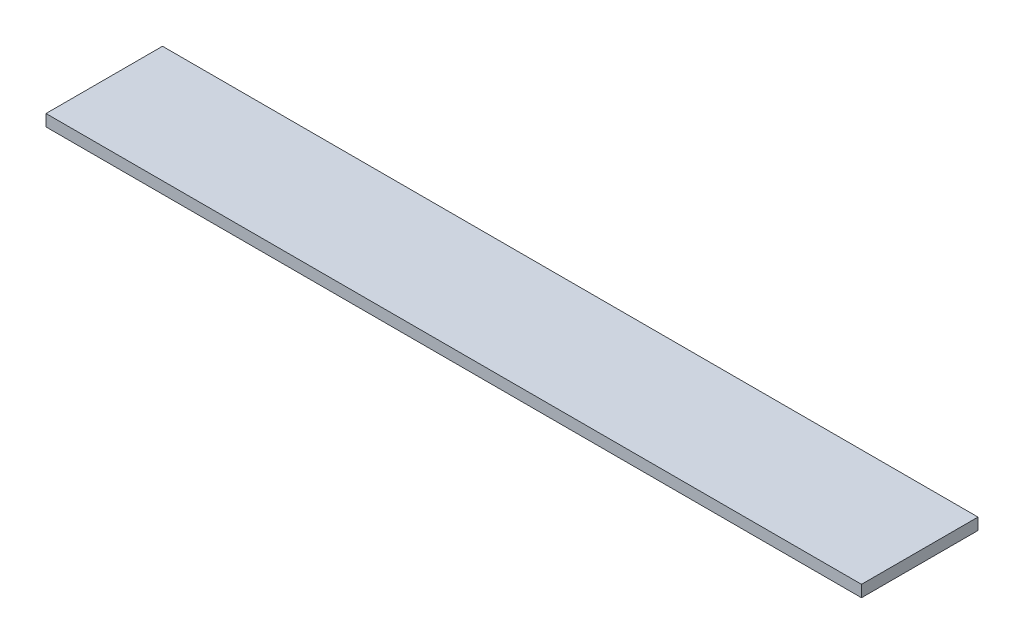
ISO-10303-21;
HEADER;
FILE_DESCRIPTION(('STEP AP214'),'2;1');
FILE_NAME('part.step','',(''),(''),'','','');
FILE_SCHEMA(('AUTOMOTIVE_DESIGN { 1 0 10303 214 1 1 1 1 }'));
ENDSEC;
DATA;
#1=APPLICATION_CONTEXT('core data for automotive mechanical design processes');
#2=APPLICATION_PROTOCOL_DEFINITION('international standard','automotive_design',2000,#1);
#3=PRODUCT_CONTEXT('',#1,'mechanical');
#4=PRODUCT('Part','Part','',(#3));
#5=PRODUCT_RELATED_PRODUCT_CATEGORY('part','',(#4));
#6=PRODUCT_DEFINITION_FORMATION('','',#4);
#7=PRODUCT_DEFINITION_CONTEXT('part definition',#1,'design');
#8=PRODUCT_DEFINITION('design','',#6,#7);
#9=PRODUCT_DEFINITION_SHAPE('','',#8);
#10=(LENGTH_UNIT() NAMED_UNIT(*) SI_UNIT(.MILLI.,.METRE.));
#11=(NAMED_UNIT(*) PLANE_ANGLE_UNIT() SI_UNIT($,.RADIAN.));
#12=(NAMED_UNIT(*) SI_UNIT($,.STERADIAN.) SOLID_ANGLE_UNIT());
#13=UNCERTAINTY_MEASURE_WITH_UNIT(LENGTH_MEASURE(1.E-05),#10,'distance_accuracy_value','');
#14=(GEOMETRIC_REPRESENTATION_CONTEXT(3) GLOBAL_UNCERTAINTY_ASSIGNED_CONTEXT((#13)) GLOBAL_UNIT_ASSIGNED_CONTEXT((#10,
#11,#12)) REPRESENTATION_CONTEXT('',''));
#15=CARTESIAN_POINT('',(0.,0.,0.));
#16=DIRECTION('',(0.,0.,1.));
#17=DIRECTION('',(1.,0.,0.));
#18=AXIS2_PLACEMENT_3D('',#15,#16,#17);
#19=CARTESIAN_POINT('',(-3500.,100.,-500.));
#20=DIRECTION('',(1.,0.,0.));
#21=DIRECTION('',(0.,0.,-1.));
#22=AXIS2_PLACEMENT_3D('',#19,#20,#21);
#23=PLANE('',#22);
#24=DIRECTION('',(0.,0.,1.));
#25=VECTOR('',#24,1.);
#26=CARTESIAN_POINT('',(-3500.,0.,-500.));
#27=LINE('',#26,#25);
#28=CARTESIAN_POINT('',(-3500.,0.,-500.));
#29=VERTEX_POINT('',#28);
#30=CARTESIAN_POINT('',(-3500.,0.,500.));
#31=VERTEX_POINT('',#30);
#32=EDGE_CURVE('E99',#29,#31,#27,.T.);
#33=ORIENTED_EDGE('',*,*,#32,.T.);
#34=DIRECTION('',(0.,-1.,0.));
#35=VECTOR('',#34,1.);
#36=CARTESIAN_POINT('',(-3500.,100.,500.));
#37=LINE('',#36,#35);
#38=CARTESIAN_POINT('',(-3500.,100.,500.));
#39=VERTEX_POINT('',#38);
#40=EDGE_CURVE('E11',#39,#31,#37,.T.);
#41=ORIENTED_EDGE('',*,*,#40,.F.);
#42=DIRECTION('',(0.,0.,1.));
#43=VECTOR('',#42,1.);
#44=CARTESIAN_POINT('',(-3500.,100.,-500.));
#45=LINE('',#44,#43);
#46=CARTESIAN_POINT('',(-3500.,100.,-500.));
#47=VERTEX_POINT('',#46);
#48=EDGE_CURVE('E87',#47,#39,#45,.T.);
#49=ORIENTED_EDGE('',*,*,#48,.F.);
#50=DIRECTION('',(0.,-1.,0.));
#51=VECTOR('',#50,1.);
#52=CARTESIAN_POINT('',(-3500.,100.,-500.));
#53=LINE('',#52,#51);
#54=EDGE_CURVE('E95',#47,#29,#53,.T.);
#55=ORIENTED_EDGE('',*,*,#54,.T.);
#56=EDGE_LOOP('',(#33,#41,#49,#55));
#57=FACE_BOUND('',#56,.T.);
#58=ADVANCED_FACE('F36',(#57),#23,.F.);
#59=CARTESIAN_POINT('',(-3500.,100.,500.));
#60=DIRECTION('',(0.,0.,-1.));
#61=DIRECTION('',(-1.,0.,0.));
#62=AXIS2_PLACEMENT_3D('',#59,#60,#61);
#63=PLANE('',#62);
#64=DIRECTION('',(1.,0.,0.));
#65=VECTOR('',#64,1.);
#66=CARTESIAN_POINT('',(-3500.,0.,500.));
#67=LINE('',#66,#65);
#68=CARTESIAN_POINT('',(3500.,0.,500.));
#69=VERTEX_POINT('',#68);
#70=EDGE_CURVE('E91',#31,#69,#67,.T.);
#71=ORIENTED_EDGE('',*,*,#70,.T.);
#72=DIRECTION('',(0.,-1.,0.));
#73=VECTOR('',#72,1.);
#74=CARTESIAN_POINT('',(3500.,100.,500.));
#75=LINE('',#74,#73);
#76=CARTESIAN_POINT('',(3500.,100.,500.));
#77=VERTEX_POINT('',#76);
#78=EDGE_CURVE('E44',#77,#69,#75,.T.);
#79=ORIENTED_EDGE('',*,*,#78,.F.);
#80=DIRECTION('',(1.,0.,0.));
#81=VECTOR('',#80,1.);
#82=CARTESIAN_POINT('',(-3500.,100.,500.));
#83=LINE('',#82,#81);
#84=EDGE_CURVE('E82',#39,#77,#83,.T.);
#85=ORIENTED_EDGE('',*,*,#84,.F.);
#86=ORIENTED_EDGE('',*,*,#40,.T.);
#87=EDGE_LOOP('',(#71,#79,#85,#86));
#88=FACE_BOUND('',#87,.T.);
#89=ADVANCED_FACE('F90',(#88),#63,.F.);
#90=CARTESIAN_POINT('',(3500.,100.,-500.));
#91=DIRECTION('',(-1.,0.,0.));
#92=DIRECTION('',(0.,0.,1.));
#93=AXIS2_PLACEMENT_3D('',#90,#91,#92);
#94=PLANE('',#93);
#95=DIRECTION('',(0.,0.,-1.));
#96=VECTOR('',#95,1.);
#97=CARTESIAN_POINT('',(3500.,0.,-500.));
#98=LINE('',#97,#96);
#99=CARTESIAN_POINT('',(3500.,0.,-500.));
#100=VERTEX_POINT('',#99);
#101=EDGE_CURVE('E69',#69,#100,#98,.T.);
#102=ORIENTED_EDGE('',*,*,#101,.T.);
#103=DIRECTION('',(0.,-1.,0.));
#104=VECTOR('',#103,1.);
#105=CARTESIAN_POINT('',(3500.,100.,-500.));
#106=LINE('',#105,#104);
#107=CARTESIAN_POINT('',(3500.,100.,-500.));
#108=VERTEX_POINT('',#107);
#109=EDGE_CURVE('E92',#108,#100,#106,.T.);
#110=ORIENTED_EDGE('',*,*,#109,.F.);
#111=DIRECTION('',(0.,0.,-1.));
#112=VECTOR('',#111,1.);
#113=CARTESIAN_POINT('',(3500.,100.,-500.));
#114=LINE('',#113,#112);
#115=EDGE_CURVE('E85',#77,#108,#114,.T.);
#116=ORIENTED_EDGE('',*,*,#115,.F.);
#117=ORIENTED_EDGE('',*,*,#78,.T.);
#118=EDGE_LOOP('',(#102,#110,#116,#117));
#119=FACE_BOUND('',#118,.T.);
#120=ADVANCED_FACE('F93',(#119),#94,.F.);
#121=CARTESIAN_POINT('',(-3500.,100.,-500.));
#122=DIRECTION('',(0.,0.,1.));
#123=DIRECTION('',(1.,0.,0.));
#124=AXIS2_PLACEMENT_3D('',#121,#122,#123);
#125=PLANE('',#124);
#126=DIRECTION('',(-1.,0.,0.));
#127=VECTOR('',#126,1.);
#128=CARTESIAN_POINT('',(-3500.,0.,-500.));
#129=LINE('',#128,#127);
#130=EDGE_CURVE('E75',#100,#29,#129,.T.);
#131=ORIENTED_EDGE('',*,*,#130,.T.);
#132=ORIENTED_EDGE('',*,*,#54,.F.);
#133=DIRECTION('',(-1.,0.,0.));
#134=VECTOR('',#133,1.);
#135=CARTESIAN_POINT('',(-3500.,100.,-500.));
#136=LINE('',#135,#134);
#137=EDGE_CURVE('E52',#108,#47,#136,.T.);
#138=ORIENTED_EDGE('',*,*,#137,.F.);
#139=ORIENTED_EDGE('',*,*,#109,.T.);
#140=EDGE_LOOP('',(#131,#132,#138,#139));
#141=FACE_BOUND('',#140,.T.);
#142=ADVANCED_FACE('F106',(#141),#125,.F.);
#143=CARTESIAN_POINT('',(-3500.,100.,500.));
#144=DIRECTION('',(0.,1.,0.));
#145=DIRECTION('',(0.,0.,1.));
#146=AXIS2_PLACEMENT_3D('',#143,#144,#145);
#147=PLANE('',#146);
#148=ORIENTED_EDGE('',*,*,#48,.T.);
#149=ORIENTED_EDGE('',*,*,#84,.T.);
#150=ORIENTED_EDGE('',*,*,#115,.T.);
#151=ORIENTED_EDGE('',*,*,#137,.T.);
#152=EDGE_LOOP('',(#148,#149,#150,#151));
#153=FACE_BOUND('',#152,.T.);
#154=ADVANCED_FACE('F83',(#153),#147,.T.);
#155=CARTESIAN_POINT('',(-3500.,0.,500.));
#156=DIRECTION('',(0.,1.,0.));
#157=DIRECTION('',(0.,0.,1.));
#158=AXIS2_PLACEMENT_3D('',#155,#156,#157);
#159=PLANE('',#158);
#160=ORIENTED_EDGE('',*,*,#32,.F.);
#161=ORIENTED_EDGE('',*,*,#130,.F.);
#162=ORIENTED_EDGE('',*,*,#101,.F.);
#163=ORIENTED_EDGE('',*,*,#70,.F.);
#164=EDGE_LOOP('',(#160,#161,#162,#163));
#165=FACE_BOUND('',#164,.T.);
#166=ADVANCED_FACE('F109',(#165),#159,.F.);
#167=CLOSED_SHELL('',(#58,#89,#120,#142,#154,#166));
#168=MANIFOLD_SOLID_BREP('B2',#167);
#169=ADVANCED_BREP_SHAPE_REPRESENTATION('',(#18,#168),#14);
#170=SHAPE_DEFINITION_REPRESENTATION(#9,#169);
ENDSEC;
END-ISO-10303-21;
